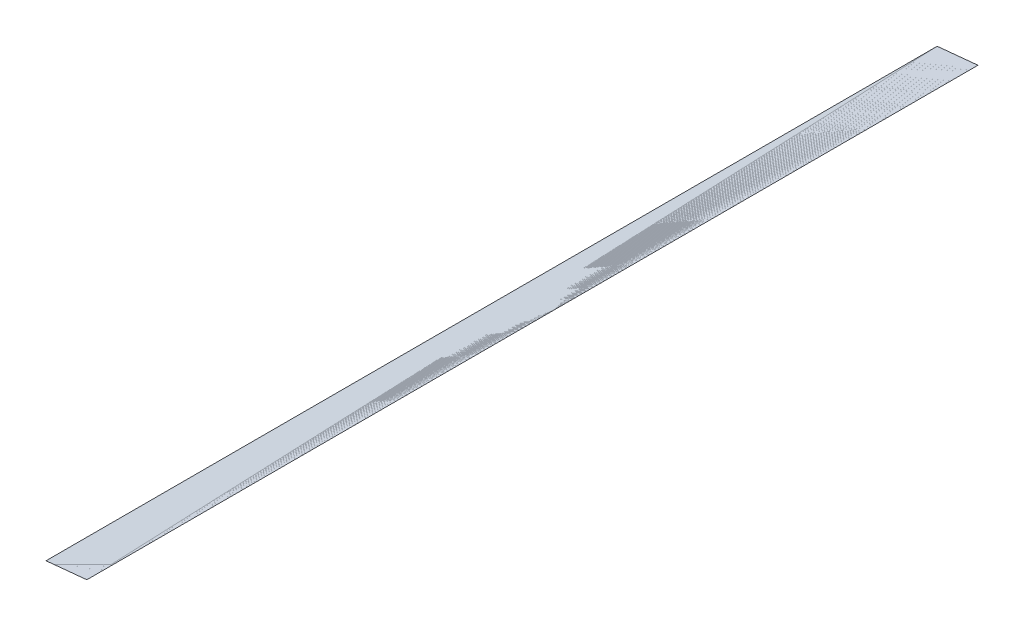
ISO-10303-21;
HEADER;
FILE_DESCRIPTION(('STEP AP214'),'2;1');
FILE_NAME('part.step','',(''),(''),'','','');
FILE_SCHEMA(('AUTOMOTIVE_DESIGN { 1 0 10303 214 1 1 1 1 }'));
ENDSEC;
DATA;
#1=APPLICATION_CONTEXT('core data for automotive mechanical design processes');
#2=APPLICATION_PROTOCOL_DEFINITION('international standard','automotive_design',2000,#1);
#3=PRODUCT_CONTEXT('',#1,'mechanical');
#4=PRODUCT('Part','Part','',(#3));
#5=PRODUCT_RELATED_PRODUCT_CATEGORY('part','',(#4));
#6=PRODUCT_DEFINITION_FORMATION('','',#4);
#7=PRODUCT_DEFINITION_CONTEXT('part definition',#1,'design');
#8=PRODUCT_DEFINITION('design','',#6,#7);
#9=PRODUCT_DEFINITION_SHAPE('','',#8);
#10=(LENGTH_UNIT() NAMED_UNIT(*) SI_UNIT(.MILLI.,.METRE.));
#11=(NAMED_UNIT(*) PLANE_ANGLE_UNIT() SI_UNIT($,.RADIAN.));
#12=(NAMED_UNIT(*) SI_UNIT($,.STERADIAN.) SOLID_ANGLE_UNIT());
#13=UNCERTAINTY_MEASURE_WITH_UNIT(LENGTH_MEASURE(1.E-05),#10,'distance_accuracy_value','');
#14=(GEOMETRIC_REPRESENTATION_CONTEXT(3) GLOBAL_UNCERTAINTY_ASSIGNED_CONTEXT((#13)) GLOBAL_UNIT_ASSIGNED_CONTEXT((#10,
#11,#12)) REPRESENTATION_CONTEXT('',''));
#15=CARTESIAN_POINT('',(0.,0.,0.));
#16=DIRECTION('',(0.,0.,1.));
#17=DIRECTION('',(1.,0.,0.));
#18=AXIS2_PLACEMENT_3D('',#15,#16,#17);
#19=CARTESIAN_POINT('',(-287.207035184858,1142.35465313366,-920.868957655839));
#20=DIRECTION('',(1.46794751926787E-06,-0.999999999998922,-2.65502651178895E-08));
#21=DIRECTION('',(-0.999999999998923,-1.46794751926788E-06,0.));
#22=AXIS2_PLACEMENT_3D('',#19,#20,#21);
#23=PLANE('',#22);
#24=CARTESIAN_POINT('',(-234.132293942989,1142.35473032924,-893.925416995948));
#25=DIRECTION('',(0.999999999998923,1.4679469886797E-06,0.));
#26=VECTOR('',#25,1.);
#27=LINE('',#24,#26);
#28=CARTESIAN_POINT('',(-234.131722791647,1142.34578348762,-893.925416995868));
#29=VERTEX_POINT('',#28);
#30=CARTESIAN_POINT('',(-234.040060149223,1142.35473046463,-893.925416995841));
#31=VERTEX_POINT('',#30);
#32=EDGE_CURVE('E43',#29,#31,#27,.T.);
#33=ORIENTED_EDGE('',*,*,#32,.T.);
#34=DIRECTION('',(0.,0.,-1.));
#35=VECTOR('',#34,1.);
#36=CARTESIAN_POINT('',(-234.040060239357,1142.35473046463,-895.925416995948));
#37=LINE('',#36,#35);
#38=CARTESIAN_POINT('',(-234.040060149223,1142.35473048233,-895.925416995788));
#39=VERTEX_POINT('',#38);
#40=EDGE_CURVE('E41',#31,#39,#37,.T.);
#41=ORIENTED_EDGE('',*,*,#40,.T.);
#42=CARTESIAN_POINT('',(-234.040059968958,1142.35473051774,-895.925416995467));
#43=DIRECTION('',(-0.999999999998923,-1.46794698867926E-06,0.));
#44=VECTOR('',#43,1.);
#45=LINE('',#42,#44);
#46=CARTESIAN_POINT('',(-234.131722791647,1142.34578351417,-895.925416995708));
#47=VERTEX_POINT('',#46);
#48=EDGE_CURVE('E28',#39,#47,#45,.T.);
#49=ORIENTED_EDGE('',*,*,#48,.T.);
#50=CARTESIAN_POINT('',(-234.132293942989,1142.35473038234,-895.925416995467));
#51=DIRECTION('',(0.,-2.65503175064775E-08,1.));
#52=VECTOR('',#51,1.);
#53=LINE('',#50,#52);
#54=EDGE_CURVE('E11',#47,#29,#53,.T.);
#55=ORIENTED_EDGE('',*,*,#54,.T.);
#56=EDGE_LOOP('',(#33,#41,#49,#55));
#57=FACE_BOUND('',#56,.T.);
#58=ADVANCED_FACE('F16',(#57),#23,.F.);
#59=CARTESIAN_POINT('',(-234.132293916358,1142.3366122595,-895.925416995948));
#60=DIRECTION('',(-0.192754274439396,0.981247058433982,0.));
#61=DIRECTION('',(0.981247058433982,0.192754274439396,0.));
#62=AXIS2_PLACEMENT_3D('',#59,#60,#61);
#63=PLANE('',#62);
#64=ORIENTED_EDGE('',*,*,#48,.F.);
#65=ORIENTED_EDGE('',*,*,#40,.F.);
#66=ORIENTED_EDGE('',*,*,#32,.F.);
#67=ORIENTED_EDGE('',*,*,#54,.F.);
#68=EDGE_LOOP('',(#64,#65,#66,#67));
#69=FACE_BOUND('',#68,.T.);
#70=ADVANCED_FACE('F18',(#69),#63,.F.);
#71=CLOSED_SHELL('',(#58,#70));
#72=MANIFOLD_SOLID_BREP('B1',#71);
#73=ADVANCED_BREP_SHAPE_REPRESENTATION('',(#18,#72),#14);
#74=SHAPE_DEFINITION_REPRESENTATION(#9,#73);
ENDSEC;
END-ISO-10303-21;
